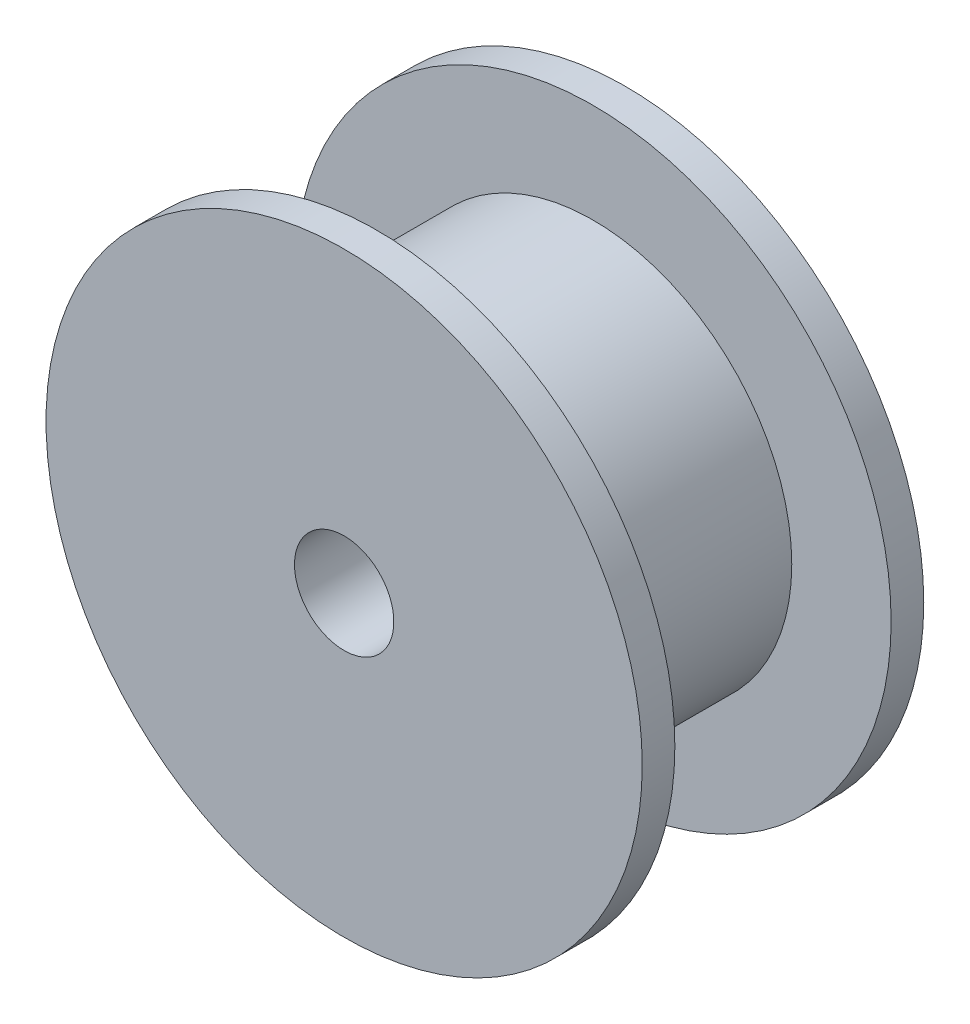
from build123d import *

# Parameters (mm, degrees)
SKETCH_2_R          = 1.5
CUT_EXTRUDE_1_DEPTH = 29


with BuildPart() as part:
    # Sketch 1 → Revolve 1 (revolve)
    with BuildSketch(Plane(origin=(0, 0, 0), x_dir=(1, 0, 0), z_dir=(0, 1, 0)), mode=Mode.PRIVATE) as revolve_1_sk:
        Polygon((0, 0), (-9, 0), (-9, 0.985), (-6, 0.985), (-6, 7.515), (-9, 7.515), (-9, 8.5), (0, 8.5), align=None)
    revolve(revolve_1_sk.sketch.rotate(Axis((0, 0, 0), (0, 0, -1)), 180), axis=Axis((0, 0, 0), (0, 0, -1)))

    # Sketch 2 → Cut-Extrude 1 (cut)
    with BuildSketch(Plane(origin=(0, 0, -8.5), x_dir=(-1, 0, 0), z_dir=(0, 0, -1))):
        Circle(SKETCH_2_R)
    extrude(amount=-CUT_EXTRUDE_1_DEPTH, mode=Mode.SUBTRACT)


solid = part.part
